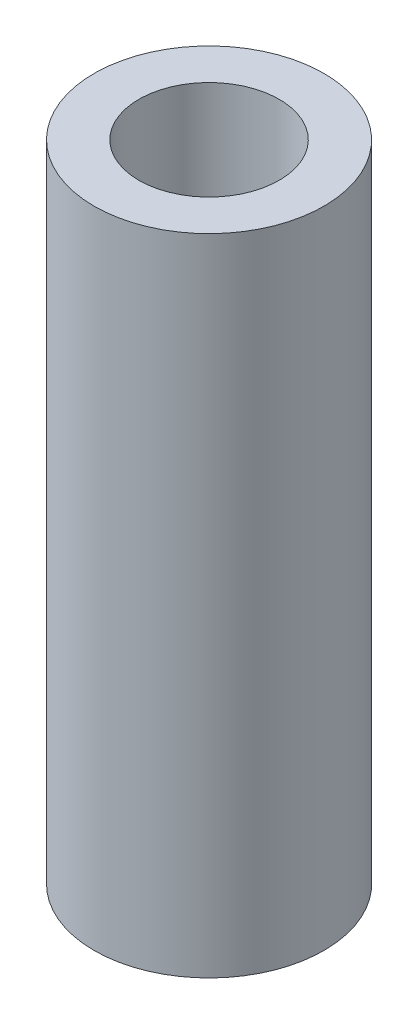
from build123d import *

# Parameters (mm, degrees)
SKETCH1_R           = 4.0767
SKETCH1_R_2         = 2.4892
BOSS_EXTRUDE1_DEPTH = 11.43


with BuildPart() as part:
    # Sketch1 → Boss-Extrude1 (new, symmetric)
    with BuildSketch(Plane(origin=(0, 0, 0), x_dir=(1, 0, 0), z_dir=(0, 1, 0))):
        with Locations(Location((0, 0, 0), (0, 0, 270))):
            Circle(SKETCH1_R)
        with Locations(Location((0, 0, 0), (0, 0, 270))):
            Circle(SKETCH1_R_2, mode=Mode.SUBTRACT)
    extrude(amount=BOSS_EXTRUDE1_DEPTH, both=True)


solid = part.part
